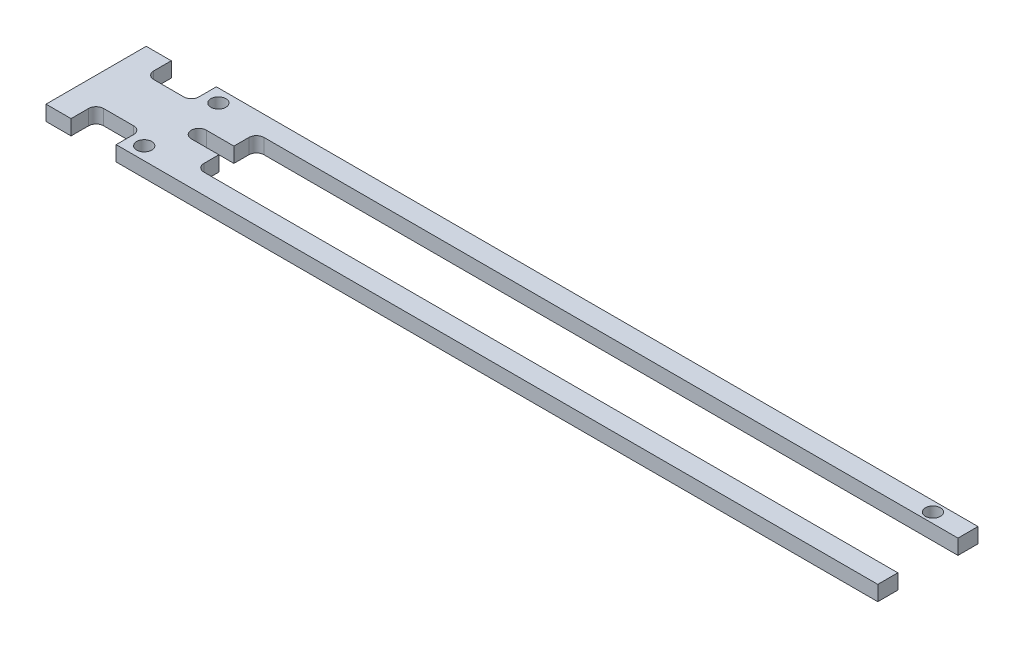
ISO-10303-21;
HEADER;
FILE_DESCRIPTION(('STEP AP214'),'2;1');
FILE_NAME('part.step','',(''),(''),'','','');
FILE_SCHEMA(('AUTOMOTIVE_DESIGN { 1 0 10303 214 1 1 1 1 }'));
ENDSEC;
DATA;
#1=APPLICATION_CONTEXT('core data for automotive mechanical design processes');
#2=APPLICATION_PROTOCOL_DEFINITION('international standard','automotive_design',2000,#1);
#3=PRODUCT_CONTEXT('',#1,'mechanical');
#4=PRODUCT('Part','Part','',(#3));
#5=PRODUCT_RELATED_PRODUCT_CATEGORY('part','',(#4));
#6=PRODUCT_DEFINITION_FORMATION('','',#4);
#7=PRODUCT_DEFINITION_CONTEXT('part definition',#1,'design');
#8=PRODUCT_DEFINITION('design','',#6,#7);
#9=PRODUCT_DEFINITION_SHAPE('','',#8);
#10=(LENGTH_UNIT() NAMED_UNIT(*) SI_UNIT(.MILLI.,.METRE.));
#11=(NAMED_UNIT(*) PLANE_ANGLE_UNIT() SI_UNIT($,.RADIAN.));
#12=(NAMED_UNIT(*) SI_UNIT($,.STERADIAN.) SOLID_ANGLE_UNIT());
#13=UNCERTAINTY_MEASURE_WITH_UNIT(LENGTH_MEASURE(1.E-05),#10,'distance_accuracy_value','');
#14=(GEOMETRIC_REPRESENTATION_CONTEXT(3) GLOBAL_UNCERTAINTY_ASSIGNED_CONTEXT((#13)) GLOBAL_UNIT_ASSIGNED_CONTEXT((#10,
#11,#12)) REPRESENTATION_CONTEXT('',''));
#15=CARTESIAN_POINT('',(0.,0.,0.));
#16=DIRECTION('',(0.,0.,1.));
#17=DIRECTION('',(1.,0.,0.));
#18=AXIS2_PLACEMENT_3D('',#15,#16,#17);
#19=CARTESIAN_POINT('',(-17.2920919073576,1.5,-0.10526315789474));
#20=DIRECTION('',(0.,-1.,0.));
#21=DIRECTION('',(0.,0.,-1.));
#22=AXIS2_PLACEMENT_3D('',#19,#20,#21);
#23=CYLINDRICAL_SURFACE('',#22,0.75);
#24=CARTESIAN_POINT('',(-17.2920919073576,0.,-0.10526315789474));
#25=DIRECTION('',(0.,1.,0.));
#26=DIRECTION('',(0.,0.,1.));
#27=AXIS2_PLACEMENT_3D('',#24,#25,#26);
#28=CIRCLE('',#27,0.75);
#29=CARTESIAN_POINT('',(-17.2920919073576,0.,-0.855263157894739));
#30=VERTEX_POINT('',#29);
#31=CARTESIAN_POINT('',(-17.2920919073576,0.,0.644736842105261));
#32=VERTEX_POINT('',#31);
#33=EDGE_CURVE('E247',#30,#32,#28,.T.);
#34=ORIENTED_EDGE('',*,*,#33,.F.);
#35=DIRECTION('',(0.,-1.,0.));
#36=VECTOR('',#35,1.);
#37=CARTESIAN_POINT('',(-17.2920919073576,1.5,-0.855263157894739));
#38=LINE('',#37,#36);
#39=CARTESIAN_POINT('',(-17.2920919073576,1.5,-0.855263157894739));
#40=VERTEX_POINT('',#39);
#41=EDGE_CURVE('E11',#40,#30,#38,.T.);
#42=ORIENTED_EDGE('',*,*,#41,.F.);
#43=CARTESIAN_POINT('',(-17.2920919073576,1.5,-0.10526315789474));
#44=DIRECTION('',(0.,1.,0.));
#45=DIRECTION('',(0.,0.,1.));
#46=AXIS2_PLACEMENT_3D('',#43,#44,#45);
#47=CIRCLE('',#46,0.75);
#48=CARTESIAN_POINT('',(-17.2920919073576,1.5,0.644736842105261));
#49=VERTEX_POINT('',#48);
#50=EDGE_CURVE('E324',#40,#49,#47,.T.);
#51=ORIENTED_EDGE('',*,*,#50,.T.);
#52=DIRECTION('',(0.,-1.,0.));
#53=VECTOR('',#52,1.);
#54=CARTESIAN_POINT('',(-17.2920919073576,1.5,0.644736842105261));
#55=LINE('',#54,#53);
#56=EDGE_CURVE('E139',#49,#32,#55,.T.);
#57=ORIENTED_EDGE('',*,*,#56,.T.);
#58=EDGE_LOOP('',(#34,#42,#51,#57));
#59=FACE_BOUND('',#58,.T.);
#60=ADVANCED_FACE('F35',(#59),#23,.F.);
#61=CARTESIAN_POINT('',(0.,1.5,-0.855263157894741));
#62=DIRECTION('',(0.,0.,1.));
#63=DIRECTION('',(1.,0.,0.));
#64=AXIS2_PLACEMENT_3D('',#61,#62,#63);
#65=PLANE('',#64);
#66=DIRECTION('',(-1.,0.,0.));
#67=VECTOR('',#66,1.);
#68=CARTESIAN_POINT('',(0.,0.,-0.855263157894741));
#69=LINE('',#68,#67);
#70=CARTESIAN_POINT('',(-14.5420919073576,0.,-0.855263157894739));
#71=VERTEX_POINT('',#70);
#72=EDGE_CURVE('E250',#71,#30,#69,.T.);
#73=ORIENTED_EDGE('',*,*,#72,.F.);
#74=DIRECTION('',(0.,-1.,0.));
#75=VECTOR('',#74,1.);
#76=CARTESIAN_POINT('',(-14.5420919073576,1.5,-0.855263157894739));
#77=LINE('',#76,#75);
#78=CARTESIAN_POINT('',(-14.5420919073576,1.5,-0.855263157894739));
#79=VERTEX_POINT('',#78);
#80=EDGE_CURVE('E43',#79,#71,#77,.T.);
#81=ORIENTED_EDGE('',*,*,#80,.F.);
#82=DIRECTION('',(-1.,0.,0.));
#83=VECTOR('',#82,1.);
#84=CARTESIAN_POINT('',(0.,1.5,-0.855263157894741));
#85=LINE('',#84,#83);
#86=EDGE_CURVE('E395',#79,#40,#85,.T.);
#87=ORIENTED_EDGE('',*,*,#86,.T.);
#88=ORIENTED_EDGE('',*,*,#41,.T.);
#89=EDGE_LOOP('',(#73,#81,#87,#88));
#90=FACE_BOUND('',#89,.T.);
#91=ADVANCED_FACE('F382',(#90),#65,.T.);
#92=CARTESIAN_POINT('',(-14.5420919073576,1.5,0.));
#93=DIRECTION('',(1.,0.,0.));
#94=DIRECTION('',(0.,0.,-1.));
#95=AXIS2_PLACEMENT_3D('',#92,#93,#94);
#96=PLANE('',#95);
#97=DIRECTION('',(0.,0.,1.));
#98=VECTOR('',#97,1.);
#99=CARTESIAN_POINT('',(-14.5420919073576,0.,0.));
#100=LINE('',#99,#98);
#101=CARTESIAN_POINT('',(-14.5420919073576,0.,-2.35526315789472));
#102=VERTEX_POINT('',#101);
#103=EDGE_CURVE('E253',#102,#71,#100,.T.);
#104=ORIENTED_EDGE('',*,*,#103,.F.);
#105=DIRECTION('',(0.,-1.,0.));
#106=VECTOR('',#105,1.);
#107=CARTESIAN_POINT('',(-14.5420919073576,1.5,-2.35526315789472));
#108=LINE('',#107,#106);
#109=CARTESIAN_POINT('',(-14.5420919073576,1.5,-2.35526315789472));
#110=VERTEX_POINT('',#109);
#111=EDGE_CURVE('E371',#110,#102,#108,.T.);
#112=ORIENTED_EDGE('',*,*,#111,.F.);
#113=DIRECTION('',(0.,0.,1.));
#114=VECTOR('',#113,1.);
#115=CARTESIAN_POINT('',(-14.5420919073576,1.5,0.));
#116=LINE('',#115,#114);
#117=EDGE_CURVE('E378',#110,#79,#116,.T.);
#118=ORIENTED_EDGE('',*,*,#117,.T.);
#119=ORIENTED_EDGE('',*,*,#80,.T.);
#120=EDGE_LOOP('',(#104,#112,#118,#119));
#121=FACE_BOUND('',#120,.T.);
#122=ADVANCED_FACE('F376',(#121),#96,.T.);
#123=CARTESIAN_POINT('',(-13.7920919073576,1.5,-2.35526315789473));
#124=DIRECTION('',(0.,-1.,0.));
#125=DIRECTION('',(0.,0.,-1.));
#126=AXIS2_PLACEMENT_3D('',#123,#124,#125);
#127=CYLINDRICAL_SURFACE('',#126,0.75);
#128=CARTESIAN_POINT('',(-13.7920919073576,0.,-2.35526315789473));
#129=DIRECTION('',(0.,1.,0.));
#130=DIRECTION('',(0.,0.,1.));
#131=AXIS2_PLACEMENT_3D('',#128,#129,#130);
#132=CIRCLE('',#131,0.75);
#133=CARTESIAN_POINT('',(-13.7920919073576,0.,-3.10526315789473));
#134=VERTEX_POINT('',#133);
#135=EDGE_CURVE('E256',#134,#102,#132,.T.);
#136=ORIENTED_EDGE('',*,*,#135,.F.);
#137=DIRECTION('',(0.,-1.,0.));
#138=VECTOR('',#137,1.);
#139=CARTESIAN_POINT('',(-13.7920919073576,1.5,-3.10526315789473));
#140=LINE('',#139,#138);
#141=CARTESIAN_POINT('',(-13.7920919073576,1.5,-3.10526315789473));
#142=VERTEX_POINT('',#141);
#143=EDGE_CURVE('E369',#142,#134,#140,.T.);
#144=ORIENTED_EDGE('',*,*,#143,.F.);
#145=CARTESIAN_POINT('',(-13.7920919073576,1.5,-2.35526315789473));
#146=DIRECTION('',(0.,1.,0.));
#147=DIRECTION('',(0.,0.,1.));
#148=AXIS2_PLACEMENT_3D('',#145,#146,#147);
#149=CIRCLE('',#148,0.75);
#150=EDGE_CURVE('E392',#142,#110,#149,.T.);
#151=ORIENTED_EDGE('',*,*,#150,.T.);
#152=ORIENTED_EDGE('',*,*,#111,.T.);
#153=EDGE_LOOP('',(#136,#144,#151,#152));
#154=FACE_BOUND('',#153,.T.);
#155=ADVANCED_FACE('F389',(#154),#127,.F.);
#156=CARTESIAN_POINT('',(0.,1.5,-3.10526315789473));
#157=DIRECTION('',(0.,0.,1.));
#158=DIRECTION('',(1.,0.,0.));
#159=AXIS2_PLACEMENT_3D('',#156,#157,#158);
#160=PLANE('',#159);
#161=DIRECTION('',(-1.,0.,0.));
#162=VECTOR('',#161,1.);
#163=CARTESIAN_POINT('',(0.,0.,-3.10526315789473));
#164=LINE('',#163,#162);
#165=CARTESIAN_POINT('',(55.4579080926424,0.,-3.10526315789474));
#166=VERTEX_POINT('',#165);
#167=EDGE_CURVE('E259',#166,#134,#164,.T.);
#168=ORIENTED_EDGE('',*,*,#167,.F.);
#169=DIRECTION('',(0.,-1.,0.));
#170=VECTOR('',#169,1.);
#171=CARTESIAN_POINT('',(55.4579080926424,1.5,-3.10526315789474));
#172=LINE('',#171,#170);
#173=CARTESIAN_POINT('',(55.4579080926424,1.5,-3.10526315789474));
#174=VERTEX_POINT('',#173);
#175=EDGE_CURVE('E367',#174,#166,#172,.T.);
#176=ORIENTED_EDGE('',*,*,#175,.F.);
#177=DIRECTION('',(-1.,0.,0.));
#178=VECTOR('',#177,1.);
#179=CARTESIAN_POINT('',(0.,1.5,-3.10526315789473));
#180=LINE('',#179,#178);
#181=EDGE_CURVE('E397',#174,#142,#180,.T.);
#182=ORIENTED_EDGE('',*,*,#181,.T.);
#183=ORIENTED_EDGE('',*,*,#143,.T.);
#184=EDGE_LOOP('',(#168,#176,#182,#183));
#185=FACE_BOUND('',#184,.T.);
#186=ADVANCED_FACE('F688',(#185),#160,.T.);
#187=CARTESIAN_POINT('',(55.4579080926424,1.5,0.));
#188=DIRECTION('',(1.,0.,0.));
#189=DIRECTION('',(0.,0.,-1.));
#190=AXIS2_PLACEMENT_3D('',#187,#188,#189);
#191=PLANE('',#190);
#192=DIRECTION('',(0.,0.,1.));
#193=VECTOR('',#192,1.);
#194=CARTESIAN_POINT('',(55.4579080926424,0.,0.));
#195=LINE('',#194,#193);
#196=CARTESIAN_POINT('',(55.4579080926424,0.,-5.10526315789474));
#197=VERTEX_POINT('',#196);
#198=EDGE_CURVE('E262',#197,#166,#195,.T.);
#199=ORIENTED_EDGE('',*,*,#198,.F.);
#200=DIRECTION('',(0.,-1.,0.));
#201=VECTOR('',#200,1.);
#202=CARTESIAN_POINT('',(55.4579080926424,1.5,-5.10526315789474));
#203=LINE('',#202,#201);
#204=CARTESIAN_POINT('',(55.4579080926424,1.5,-5.10526315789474));
#205=VERTEX_POINT('',#204);
#206=EDGE_CURVE('E365',#205,#197,#203,.T.);
#207=ORIENTED_EDGE('',*,*,#206,.F.);
#208=DIRECTION('',(0.,0.,1.));
#209=VECTOR('',#208,1.);
#210=CARTESIAN_POINT('',(55.4579080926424,1.5,0.));
#211=LINE('',#210,#209);
#212=EDGE_CURVE('E403',#205,#174,#211,.T.);
#213=ORIENTED_EDGE('',*,*,#212,.T.);
#214=ORIENTED_EDGE('',*,*,#175,.T.);
#215=EDGE_LOOP('',(#199,#207,#213,#214));
#216=FACE_BOUND('',#215,.T.);
#217=ADVANCED_FACE('F679',(#216),#191,.T.);
#218=CARTESIAN_POINT('',(0.,1.5,-5.10526315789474));
#219=DIRECTION('',(0.,0.,-1.));
#220=DIRECTION('',(-1.,0.,0.));
#221=AXIS2_PLACEMENT_3D('',#218,#219,#220);
#222=PLANE('',#221);
#223=DIRECTION('',(1.,0.,0.));
#224=VECTOR('',#223,1.);
#225=CARTESIAN_POINT('',(0.,0.,-5.10526315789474));
#226=LINE('',#225,#224);
#227=CARTESIAN_POINT('',(-20.5420919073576,0.,-5.10526315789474));
#228=VERTEX_POINT('',#227);
#229=EDGE_CURVE('E265',#228,#197,#226,.T.);
#230=ORIENTED_EDGE('',*,*,#229,.F.);
#231=DIRECTION('',(0.,-1.,0.));
#232=VECTOR('',#231,1.);
#233=CARTESIAN_POINT('',(-20.5420919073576,1.5,-5.10526315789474));
#234=LINE('',#233,#232);
#235=CARTESIAN_POINT('',(-20.5420919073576,1.5,-5.10526315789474));
#236=VERTEX_POINT('',#235);
#237=EDGE_CURVE('E363',#236,#228,#234,.T.);
#238=ORIENTED_EDGE('',*,*,#237,.F.);
#239=DIRECTION('',(1.,0.,0.));
#240=VECTOR('',#239,1.);
#241=CARTESIAN_POINT('',(0.,1.5,-5.10526315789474));
#242=LINE('',#241,#240);
#243=EDGE_CURVE('E406',#236,#205,#242,.T.);
#244=ORIENTED_EDGE('',*,*,#243,.T.);
#245=ORIENTED_EDGE('',*,*,#206,.T.);
#246=EDGE_LOOP('',(#230,#238,#244,#245));
#247=FACE_BOUND('',#246,.T.);
#248=ADVANCED_FACE('F670',(#247),#222,.T.);
#249=CARTESIAN_POINT('',(-20.5420919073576,1.5,0.));
#250=DIRECTION('',(-1.,0.,0.));
#251=DIRECTION('',(0.,0.,1.));
#252=AXIS2_PLACEMENT_3D('',#249,#250,#251);
#253=PLANE('',#252);
#254=DIRECTION('',(0.,0.,-1.));
#255=VECTOR('',#254,1.);
#256=CARTESIAN_POINT('',(-20.5420919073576,0.,0.));
#257=LINE('',#256,#255);
#258=CARTESIAN_POINT('',(-20.5420919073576,0.,-3.35526315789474));
#259=VERTEX_POINT('',#258);
#260=EDGE_CURVE('E268',#259,#228,#257,.T.);
#261=ORIENTED_EDGE('',*,*,#260,.F.);
#262=DIRECTION('',(0.,-1.,0.));
#263=VECTOR('',#262,1.);
#264=CARTESIAN_POINT('',(-20.5420919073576,1.5,-3.35526315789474));
#265=LINE('',#264,#263);
#266=CARTESIAN_POINT('',(-20.5420919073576,1.5,-3.35526315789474));
#267=VERTEX_POINT('',#266);
#268=EDGE_CURVE('E361',#267,#259,#265,.T.);
#269=ORIENTED_EDGE('',*,*,#268,.F.);
#270=DIRECTION('',(0.,0.,-1.));
#271=VECTOR('',#270,1.);
#272=CARTESIAN_POINT('',(-20.5420919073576,1.5,0.));
#273=LINE('',#272,#271);
#274=EDGE_CURVE('E409',#267,#236,#273,.T.);
#275=ORIENTED_EDGE('',*,*,#274,.T.);
#276=ORIENTED_EDGE('',*,*,#237,.T.);
#277=EDGE_LOOP('',(#261,#269,#275,#276));
#278=FACE_BOUND('',#277,.T.);
#279=ADVANCED_FACE('F661',(#278),#253,.T.);
#280=CARTESIAN_POINT('',(-21.2920919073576,1.5,-3.35526315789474));
#281=DIRECTION('',(0.,-1.,0.));
#282=DIRECTION('',(0.,0.,-1.));
#283=AXIS2_PLACEMENT_3D('',#280,#281,#282);
#284=CYLINDRICAL_SURFACE('',#283,0.75);
#285=CARTESIAN_POINT('',(-21.2920919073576,0.,-3.35526315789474));
#286=DIRECTION('',(0.,1.,0.));
#287=DIRECTION('',(0.,0.,1.));
#288=AXIS2_PLACEMENT_3D('',#285,#286,#287);
#289=CIRCLE('',#288,0.75);
#290=CARTESIAN_POINT('',(-21.2920919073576,0.,-2.60526315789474));
#291=VERTEX_POINT('',#290);
#292=EDGE_CURVE('E271',#291,#259,#289,.T.);
#293=ORIENTED_EDGE('',*,*,#292,.F.);
#294=DIRECTION('',(0.,-1.,0.));
#295=VECTOR('',#294,1.);
#296=CARTESIAN_POINT('',(-21.2920919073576,1.5,-2.60526315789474));
#297=LINE('',#296,#295);
#298=CARTESIAN_POINT('',(-21.2920919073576,1.5,-2.60526315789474));
#299=VERTEX_POINT('',#298);
#300=EDGE_CURVE('E359',#299,#291,#297,.T.);
#301=ORIENTED_EDGE('',*,*,#300,.F.);
#302=CARTESIAN_POINT('',(-21.2920919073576,1.5,-3.35526315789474));
#303=DIRECTION('',(0.,1.,0.));
#304=DIRECTION('',(0.,0.,1.));
#305=AXIS2_PLACEMENT_3D('',#302,#303,#304);
#306=CIRCLE('',#305,0.75);
#307=EDGE_CURVE('E412',#299,#267,#306,.T.);
#308=ORIENTED_EDGE('',*,*,#307,.T.);
#309=ORIENTED_EDGE('',*,*,#268,.T.);
#310=EDGE_LOOP('',(#293,#301,#308,#309));
#311=FACE_BOUND('',#310,.T.);
#312=ADVANCED_FACE('F652',(#311),#284,.F.);
#313=CARTESIAN_POINT('',(0.,1.5,-2.60526315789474));
#314=DIRECTION('',(0.,0.,-1.));
#315=DIRECTION('',(-1.,0.,0.));
#316=AXIS2_PLACEMENT_3D('',#313,#314,#315);
#317=PLANE('',#316);
#318=DIRECTION('',(1.,0.,0.));
#319=VECTOR('',#318,1.);
#320=CARTESIAN_POINT('',(0.,0.,-2.60526315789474));
#321=LINE('',#320,#319);
#322=CARTESIAN_POINT('',(-24.2920919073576,0.,-2.60526315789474));
#323=VERTEX_POINT('',#322);
#324=EDGE_CURVE('E274',#323,#291,#321,.T.);
#325=ORIENTED_EDGE('',*,*,#324,.F.);
#326=DIRECTION('',(0.,-1.,0.));
#327=VECTOR('',#326,1.);
#328=CARTESIAN_POINT('',(-24.2920919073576,1.5,-2.60526315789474));
#329=LINE('',#328,#327);
#330=CARTESIAN_POINT('',(-24.2920919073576,1.5,-2.60526315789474));
#331=VERTEX_POINT('',#330);
#332=EDGE_CURVE('E357',#331,#323,#329,.T.);
#333=ORIENTED_EDGE('',*,*,#332,.F.);
#334=DIRECTION('',(1.,0.,0.));
#335=VECTOR('',#334,1.);
#336=CARTESIAN_POINT('',(0.,1.5,-2.60526315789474));
#337=LINE('',#336,#335);
#338=EDGE_CURVE('E415',#331,#299,#337,.T.);
#339=ORIENTED_EDGE('',*,*,#338,.T.);
#340=ORIENTED_EDGE('',*,*,#300,.T.);
#341=EDGE_LOOP('',(#325,#333,#339,#340));
#342=FACE_BOUND('',#341,.T.);
#343=ADVANCED_FACE('F643',(#342),#317,.T.);
#344=CARTESIAN_POINT('',(-24.2920919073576,1.5,-3.35526315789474));
#345=DIRECTION('',(0.,-1.,0.));
#346=DIRECTION('',(0.,0.,-1.));
#347=AXIS2_PLACEMENT_3D('',#344,#345,#346);
#348=CYLINDRICAL_SURFACE('',#347,0.749999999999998);
#349=CARTESIAN_POINT('',(-24.2920919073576,0.,-3.35526315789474));
#350=DIRECTION('',(0.,1.,0.));
#351=DIRECTION('',(0.,0.,1.));
#352=AXIS2_PLACEMENT_3D('',#349,#350,#351);
#353=CIRCLE('',#352,0.749999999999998);
#354=CARTESIAN_POINT('',(-25.0420919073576,0.,-3.35526315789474));
#355=VERTEX_POINT('',#354);
#356=EDGE_CURVE('E277',#323,#355,#353,.F.);
#357=ORIENTED_EDGE('',*,*,#356,.T.);
#358=DIRECTION('',(0.,-1.,0.));
#359=VECTOR('',#358,1.);
#360=CARTESIAN_POINT('',(-25.0420919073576,1.5,-3.35526315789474));
#361=LINE('',#360,#359);
#362=CARTESIAN_POINT('',(-25.0420919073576,1.5,-3.35526315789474));
#363=VERTEX_POINT('',#362);
#364=EDGE_CURVE('E355',#363,#355,#361,.T.);
#365=ORIENTED_EDGE('',*,*,#364,.F.);
#366=CARTESIAN_POINT('',(-24.2920919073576,1.5,-3.35526315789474));
#367=DIRECTION('',(0.,1.,0.));
#368=DIRECTION('',(0.,0.,1.));
#369=AXIS2_PLACEMENT_3D('',#366,#367,#368);
#370=CIRCLE('',#369,0.749999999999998);
#371=EDGE_CURVE('E418',#331,#363,#370,.F.);
#372=ORIENTED_EDGE('',*,*,#371,.F.);
#373=ORIENTED_EDGE('',*,*,#332,.T.);
#374=EDGE_LOOP('',(#357,#365,#372,#373));
#375=FACE_BOUND('',#374,.T.);
#376=ADVANCED_FACE('F634',(#375),#348,.F.);
#377=CARTESIAN_POINT('',(-25.0420919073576,1.5,0.));
#378=DIRECTION('',(1.,0.,0.));
#379=DIRECTION('',(0.,0.,-1.));
#380=AXIS2_PLACEMENT_3D('',#377,#378,#379);
#381=PLANE('',#380);
#382=DIRECTION('',(0.,0.,1.));
#383=VECTOR('',#382,1.);
#384=CARTESIAN_POINT('',(-25.0420919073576,0.,0.));
#385=LINE('',#384,#383);
#386=CARTESIAN_POINT('',(-25.0420919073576,0.,-5.10526315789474));
#387=VERTEX_POINT('',#386);
#388=EDGE_CURVE('E280',#387,#355,#385,.T.);
#389=ORIENTED_EDGE('',*,*,#388,.F.);
#390=DIRECTION('',(0.,-1.,0.));
#391=VECTOR('',#390,1.);
#392=CARTESIAN_POINT('',(-25.0420919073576,1.5,-5.10526315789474));
#393=LINE('',#392,#391);
#394=CARTESIAN_POINT('',(-25.0420919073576,1.5,-5.10526315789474));
#395=VERTEX_POINT('',#394);
#396=EDGE_CURVE('E353',#395,#387,#393,.T.);
#397=ORIENTED_EDGE('',*,*,#396,.F.);
#398=DIRECTION('',(0.,0.,1.));
#399=VECTOR('',#398,1.);
#400=CARTESIAN_POINT('',(-25.0420919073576,1.5,0.));
#401=LINE('',#400,#399);
#402=EDGE_CURVE('E420',#395,#363,#401,.T.);
#403=ORIENTED_EDGE('',*,*,#402,.T.);
#404=ORIENTED_EDGE('',*,*,#364,.T.);
#405=EDGE_LOOP('',(#389,#397,#403,#404));
#406=FACE_BOUND('',#405,.T.);
#407=ADVANCED_FACE('F625',(#406),#381,.T.);
#408=CARTESIAN_POINT('',(0.,1.5,-5.10526315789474));
#409=DIRECTION('',(0.,0.,-1.));
#410=DIRECTION('',(-1.,0.,0.));
#411=AXIS2_PLACEMENT_3D('',#408,#409,#410);
#412=PLANE('',#411);
#413=DIRECTION('',(1.,0.,0.));
#414=VECTOR('',#413,1.);
#415=CARTESIAN_POINT('',(0.,0.,-5.10526315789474));
#416=LINE('',#415,#414);
#417=CARTESIAN_POINT('',(-27.5420919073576,0.,-5.10526315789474));
#418=VERTEX_POINT('',#417);
#419=EDGE_CURVE('E283',#418,#387,#416,.T.);
#420=ORIENTED_EDGE('',*,*,#419,.F.);
#421=DIRECTION('',(0.,-1.,0.));
#422=VECTOR('',#421,1.);
#423=CARTESIAN_POINT('',(-27.5420919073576,1.5,-5.10526315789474));
#424=LINE('',#423,#422);
#425=CARTESIAN_POINT('',(-27.5420919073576,1.5,-5.10526315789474));
#426=VERTEX_POINT('',#425);
#427=EDGE_CURVE('E351',#426,#418,#424,.T.);
#428=ORIENTED_EDGE('',*,*,#427,.F.);
#429=DIRECTION('',(1.,0.,0.));
#430=VECTOR('',#429,1.);
#431=CARTESIAN_POINT('',(0.,1.5,-5.10526315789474));
#432=LINE('',#431,#430);
#433=EDGE_CURVE('E423',#426,#395,#432,.T.);
#434=ORIENTED_EDGE('',*,*,#433,.T.);
#435=ORIENTED_EDGE('',*,*,#396,.T.);
#436=EDGE_LOOP('',(#420,#428,#434,#435));
#437=FACE_BOUND('',#436,.T.);
#438=ADVANCED_FACE('F616',(#437),#412,.T.);
#439=CARTESIAN_POINT('',(-27.5420919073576,1.5,0.));
#440=DIRECTION('',(1.,0.,0.));
#441=DIRECTION('',(0.,0.,-1.));
#442=AXIS2_PLACEMENT_3D('',#439,#440,#441);
#443=PLANE('',#442);
#444=DIRECTION('',(0.,0.,1.));
#445=VECTOR('',#444,1.);
#446=CARTESIAN_POINT('',(-27.5420919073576,0.,0.));
#447=LINE('',#446,#445);
#448=CARTESIAN_POINT('',(-27.5420919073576,0.,4.89473684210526));
#449=VERTEX_POINT('',#448);
#450=EDGE_CURVE('E286',#418,#449,#447,.T.);
#451=ORIENTED_EDGE('',*,*,#450,.T.);
#452=DIRECTION('',(0.,-1.,0.));
#453=VECTOR('',#452,1.);
#454=CARTESIAN_POINT('',(-27.5420919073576,1.5,4.89473684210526));
#455=LINE('',#454,#453);
#456=CARTESIAN_POINT('',(-27.5420919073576,1.5,4.89473684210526));
#457=VERTEX_POINT('',#456);
#458=EDGE_CURVE('E348',#457,#449,#455,.T.);
#459=ORIENTED_EDGE('',*,*,#458,.F.);
#460=DIRECTION('',(0.,0.,1.));
#461=VECTOR('',#460,1.);
#462=CARTESIAN_POINT('',(-27.5420919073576,1.5,0.));
#463=LINE('',#462,#461);
#464=EDGE_CURVE('E426',#426,#457,#463,.T.);
#465=ORIENTED_EDGE('',*,*,#464,.F.);
#466=ORIENTED_EDGE('',*,*,#427,.T.);
#467=EDGE_LOOP('',(#451,#459,#465,#466));
#468=FACE_BOUND('',#467,.T.);
#469=ADVANCED_FACE('F607',(#468),#443,.F.);
#470=CARTESIAN_POINT('',(0.,1.5,4.89473684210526));
#471=DIRECTION('',(0.,0.,-1.));
#472=DIRECTION('',(-1.,0.,0.));
#473=AXIS2_PLACEMENT_3D('',#470,#471,#472);
#474=PLANE('',#473);
#475=DIRECTION('',(1.,0.,0.));
#476=VECTOR('',#475,1.);
#477=CARTESIAN_POINT('',(0.,0.,4.89473684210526));
#478=LINE('',#477,#476);
#479=CARTESIAN_POINT('',(-25.0420919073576,0.,4.89473684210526));
#480=VERTEX_POINT('',#479);
#481=EDGE_CURVE('E288',#449,#480,#478,.T.);
#482=ORIENTED_EDGE('',*,*,#481,.T.);
#483=DIRECTION('',(0.,-1.,0.));
#484=VECTOR('',#483,1.);
#485=CARTESIAN_POINT('',(-25.0420919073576,1.5,4.89473684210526));
#486=LINE('',#485,#484);
#487=CARTESIAN_POINT('',(-25.0420919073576,1.5,4.89473684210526));
#488=VERTEX_POINT('',#487);
#489=EDGE_CURVE('E346',#488,#480,#486,.T.);
#490=ORIENTED_EDGE('',*,*,#489,.F.);
#491=DIRECTION('',(1.,0.,0.));
#492=VECTOR('',#491,1.);
#493=CARTESIAN_POINT('',(0.,1.5,4.89473684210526));
#494=LINE('',#493,#492);
#495=EDGE_CURVE('E428',#457,#488,#494,.T.);
#496=ORIENTED_EDGE('',*,*,#495,.F.);
#497=ORIENTED_EDGE('',*,*,#458,.T.);
#498=EDGE_LOOP('',(#482,#490,#496,#497));
#499=FACE_BOUND('',#498,.T.);
#500=ADVANCED_FACE('F598',(#499),#474,.F.);
#501=CARTESIAN_POINT('',(-25.0420919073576,1.5,0.));
#502=DIRECTION('',(1.,0.,0.));
#503=DIRECTION('',(0.,0.,-1.));
#504=AXIS2_PLACEMENT_3D('',#501,#502,#503);
#505=PLANE('',#504);
#506=DIRECTION('',(0.,0.,1.));
#507=VECTOR('',#506,1.);
#508=CARTESIAN_POINT('',(-25.0420919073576,0.,0.));
#509=LINE('',#508,#507);
#510=CARTESIAN_POINT('',(-25.0420919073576,0.,3.14473684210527));
#511=VERTEX_POINT('',#510);
#512=EDGE_CURVE('E291',#511,#480,#509,.T.);
#513=ORIENTED_EDGE('',*,*,#512,.F.);
#514=DIRECTION('',(0.,-1.,0.));
#515=VECTOR('',#514,1.);
#516=CARTESIAN_POINT('',(-25.0420919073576,1.5,3.14473684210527));
#517=LINE('',#516,#515);
#518=CARTESIAN_POINT('',(-25.0420919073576,1.5,3.14473684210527));
#519=VERTEX_POINT('',#518);
#520=EDGE_CURVE('E344',#519,#511,#517,.T.);
#521=ORIENTED_EDGE('',*,*,#520,.F.);
#522=DIRECTION('',(0.,0.,1.));
#523=VECTOR('',#522,1.);
#524=CARTESIAN_POINT('',(-25.0420919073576,1.5,0.));
#525=LINE('',#524,#523);
#526=EDGE_CURVE('E430',#519,#488,#525,.T.);
#527=ORIENTED_EDGE('',*,*,#526,.T.);
#528=ORIENTED_EDGE('',*,*,#489,.T.);
#529=EDGE_LOOP('',(#513,#521,#527,#528));
#530=FACE_BOUND('',#529,.T.);
#531=ADVANCED_FACE('F589',(#530),#505,.T.);
#532=CARTESIAN_POINT('',(-24.2920919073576,1.5,3.14473684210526));
#533=DIRECTION('',(0.,-1.,0.));
#534=DIRECTION('',(0.,0.,-1.));
#535=AXIS2_PLACEMENT_3D('',#532,#533,#534);
#536=CYLINDRICAL_SURFACE('',#535,0.749999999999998);
#537=CARTESIAN_POINT('',(-24.2920919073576,0.,3.14473684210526));
#538=DIRECTION('',(0.,1.,0.));
#539=DIRECTION('',(0.,0.,1.));
#540=AXIS2_PLACEMENT_3D('',#537,#538,#539);
#541=CIRCLE('',#540,0.749999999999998);
#542=CARTESIAN_POINT('',(-24.2920919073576,0.,2.39473684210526));
#543=VERTEX_POINT('',#542);
#544=EDGE_CURVE('E294',#511,#543,#541,.F.);
#545=ORIENTED_EDGE('',*,*,#544,.T.);
#546=DIRECTION('',(0.,-1.,0.));
#547=VECTOR('',#546,1.);
#548=CARTESIAN_POINT('',(-24.2920919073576,1.5,2.39473684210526));
#549=LINE('',#548,#547);
#550=CARTESIAN_POINT('',(-24.2920919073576,1.5,2.39473684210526));
#551=VERTEX_POINT('',#550);
#552=EDGE_CURVE('E341',#551,#543,#549,.T.);
#553=ORIENTED_EDGE('',*,*,#552,.F.);
#554=CARTESIAN_POINT('',(-24.2920919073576,1.5,3.14473684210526));
#555=DIRECTION('',(0.,1.,0.));
#556=DIRECTION('',(0.,0.,1.));
#557=AXIS2_PLACEMENT_3D('',#554,#555,#556);
#558=CIRCLE('',#557,0.749999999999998);
#559=EDGE_CURVE('E433',#519,#551,#558,.F.);
#560=ORIENTED_EDGE('',*,*,#559,.F.);
#561=ORIENTED_EDGE('',*,*,#520,.T.);
#562=EDGE_LOOP('',(#545,#553,#560,#561));
#563=FACE_BOUND('',#562,.T.);
#564=ADVANCED_FACE('F580',(#563),#536,.F.);
#565=CARTESIAN_POINT('',(0.,1.5,2.39473684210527));
#566=DIRECTION('',(0.,0.,-1.));
#567=DIRECTION('',(-1.,0.,0.));
#568=AXIS2_PLACEMENT_3D('',#565,#566,#567);
#569=PLANE('',#568);
#570=DIRECTION('',(1.,0.,0.));
#571=VECTOR('',#570,1.);
#572=CARTESIAN_POINT('',(0.,0.,2.39473684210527));
#573=LINE('',#572,#571);
#574=CARTESIAN_POINT('',(-21.2920919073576,0.,2.39473684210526));
#575=VERTEX_POINT('',#574);
#576=EDGE_CURVE('E296',#543,#575,#573,.T.);
#577=ORIENTED_EDGE('',*,*,#576,.T.);
#578=DIRECTION('',(0.,-1.,0.));
#579=VECTOR('',#578,1.);
#580=CARTESIAN_POINT('',(-21.2920919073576,1.5,2.39473684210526));
#581=LINE('',#580,#579);
#582=CARTESIAN_POINT('',(-21.2920919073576,1.5,2.39473684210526));
#583=VERTEX_POINT('',#582);
#584=EDGE_CURVE('E338',#583,#575,#581,.T.);
#585=ORIENTED_EDGE('',*,*,#584,.F.);
#586=DIRECTION('',(1.,0.,0.));
#587=VECTOR('',#586,1.);
#588=CARTESIAN_POINT('',(0.,1.5,2.39473684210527));
#589=LINE('',#588,#587);
#590=EDGE_CURVE('E435',#551,#583,#589,.T.);
#591=ORIENTED_EDGE('',*,*,#590,.F.);
#592=ORIENTED_EDGE('',*,*,#552,.T.);
#593=EDGE_LOOP('',(#577,#585,#591,#592));
#594=FACE_BOUND('',#593,.T.);
#595=ADVANCED_FACE('F571',(#594),#569,.F.);
#596=CARTESIAN_POINT('',(-21.2920919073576,1.5,3.14473684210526));
#597=DIRECTION('',(0.,-1.,0.));
#598=DIRECTION('',(0.,0.,-1.));
#599=AXIS2_PLACEMENT_3D('',#596,#597,#598);
#600=CYLINDRICAL_SURFACE('',#599,0.75);
#601=CARTESIAN_POINT('',(-21.2920919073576,0.,3.14473684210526));
#602=DIRECTION('',(0.,1.,0.));
#603=DIRECTION('',(0.,0.,1.));
#604=AXIS2_PLACEMENT_3D('',#601,#602,#603);
#605=CIRCLE('',#604,0.75);
#606=CARTESIAN_POINT('',(-20.5420919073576,0.,3.14473684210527));
#607=VERTEX_POINT('',#606);
#608=EDGE_CURVE('E298',#575,#607,#605,.F.);
#609=ORIENTED_EDGE('',*,*,#608,.T.);
#610=DIRECTION('',(0.,-1.,0.));
#611=VECTOR('',#610,1.);
#612=CARTESIAN_POINT('',(-20.5420919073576,1.5,3.14473684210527));
#613=LINE('',#612,#611);
#614=CARTESIAN_POINT('',(-20.5420919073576,1.5,3.14473684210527));
#615=VERTEX_POINT('',#614);
#616=EDGE_CURVE('E335',#615,#607,#613,.T.);
#617=ORIENTED_EDGE('',*,*,#616,.F.);
#618=CARTESIAN_POINT('',(-21.2920919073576,1.5,3.14473684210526));
#619=DIRECTION('',(0.,1.,0.));
#620=DIRECTION('',(0.,0.,1.));
#621=AXIS2_PLACEMENT_3D('',#618,#619,#620);
#622=CIRCLE('',#621,0.75);
#623=EDGE_CURVE('E437',#583,#615,#622,.F.);
#624=ORIENTED_EDGE('',*,*,#623,.F.);
#625=ORIENTED_EDGE('',*,*,#584,.T.);
#626=EDGE_LOOP('',(#609,#617,#624,#625));
#627=FACE_BOUND('',#626,.T.);
#628=ADVANCED_FACE('F562',(#627),#600,.F.);
#629=CARTESIAN_POINT('',(-20.5420919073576,1.5,0.));
#630=DIRECTION('',(1.,0.,0.));
#631=DIRECTION('',(0.,0.,-1.));
#632=AXIS2_PLACEMENT_3D('',#629,#630,#631);
#633=PLANE('',#632);
#634=DIRECTION('',(0.,0.,1.));
#635=VECTOR('',#634,1.);
#636=CARTESIAN_POINT('',(-20.5420919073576,0.,0.));
#637=LINE('',#636,#635);
#638=CARTESIAN_POINT('',(-20.5420919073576,0.,4.89473684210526));
#639=VERTEX_POINT('',#638);
#640=EDGE_CURVE('E300',#607,#639,#637,.T.);
#641=ORIENTED_EDGE('',*,*,#640,.T.);
#642=DIRECTION('',(0.,-1.,0.));
#643=VECTOR('',#642,1.);
#644=CARTESIAN_POINT('',(-20.5420919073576,1.5,4.89473684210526));
#645=LINE('',#644,#643);
#646=CARTESIAN_POINT('',(-20.5420919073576,1.5,4.89473684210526));
#647=VERTEX_POINT('',#646);
#648=EDGE_CURVE('E332',#647,#639,#645,.T.);
#649=ORIENTED_EDGE('',*,*,#648,.F.);
#650=DIRECTION('',(0.,0.,1.));
#651=VECTOR('',#650,1.);
#652=CARTESIAN_POINT('',(-20.5420919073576,1.5,0.));
#653=LINE('',#652,#651);
#654=EDGE_CURVE('E439',#615,#647,#653,.T.);
#655=ORIENTED_EDGE('',*,*,#654,.F.);
#656=ORIENTED_EDGE('',*,*,#616,.T.);
#657=EDGE_LOOP('',(#641,#649,#655,#656));
#658=FACE_BOUND('',#657,.T.);
#659=ADVANCED_FACE('F554',(#658),#633,.F.);
#660=CARTESIAN_POINT('',(0.,1.5,4.89473684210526));
#661=DIRECTION('',(0.,0.,-1.));
#662=DIRECTION('',(-1.,0.,0.));
#663=AXIS2_PLACEMENT_3D('',#660,#661,#662);
#664=PLANE('',#663);
#665=DIRECTION('',(1.,0.,0.));
#666=VECTOR('',#665,1.);
#667=CARTESIAN_POINT('',(0.,0.,4.89473684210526));
#668=LINE('',#667,#666);
#669=CARTESIAN_POINT('',(55.4579080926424,0.,4.89473684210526));
#670=VERTEX_POINT('',#669);
#671=EDGE_CURVE('E302',#639,#670,#668,.T.);
#672=ORIENTED_EDGE('',*,*,#671,.T.);
#673=DIRECTION('',(0.,-1.,0.));
#674=VECTOR('',#673,1.);
#675=CARTESIAN_POINT('',(55.4579080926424,1.5,4.89473684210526));
#676=LINE('',#675,#674);
#677=CARTESIAN_POINT('',(55.4579080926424,1.5,4.89473684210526));
#678=VERTEX_POINT('',#677);
#679=EDGE_CURVE('E330',#678,#670,#676,.T.);
#680=ORIENTED_EDGE('',*,*,#679,.F.);
#681=DIRECTION('',(1.,0.,0.));
#682=VECTOR('',#681,1.);
#683=CARTESIAN_POINT('',(0.,1.5,4.89473684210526));
#684=LINE('',#683,#682);
#685=EDGE_CURVE('E441',#647,#678,#684,.T.);
#686=ORIENTED_EDGE('',*,*,#685,.F.);
#687=ORIENTED_EDGE('',*,*,#648,.T.);
#688=EDGE_LOOP('',(#672,#680,#686,#687));
#689=FACE_BOUND('',#688,.T.);
#690=ADVANCED_FACE('F453',(#689),#664,.F.);
#691=CARTESIAN_POINT('',(55.4579080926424,1.5,0.));
#692=DIRECTION('',(1.,0.,0.));
#693=DIRECTION('',(0.,0.,-1.));
#694=AXIS2_PLACEMENT_3D('',#691,#692,#693);
#695=PLANE('',#694);
#696=DIRECTION('',(0.,0.,1.));
#697=VECTOR('',#696,1.);
#698=CARTESIAN_POINT('',(55.4579080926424,0.,0.));
#699=LINE('',#698,#697);
#700=CARTESIAN_POINT('',(55.4579080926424,0.,2.89473684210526));
#701=VERTEX_POINT('',#700);
#702=EDGE_CURVE('E305',#701,#670,#699,.T.);
#703=ORIENTED_EDGE('',*,*,#702,.F.);
#704=DIRECTION('',(0.,-1.,0.));
#705=VECTOR('',#704,1.);
#706=CARTESIAN_POINT('',(55.4579080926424,1.5,2.89473684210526));
#707=LINE('',#706,#705);
#708=CARTESIAN_POINT('',(55.4579080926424,1.5,2.89473684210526));
#709=VERTEX_POINT('',#708);
#710=EDGE_CURVE('E328',#709,#701,#707,.T.);
#711=ORIENTED_EDGE('',*,*,#710,.F.);
#712=DIRECTION('',(0.,0.,1.));
#713=VECTOR('',#712,1.);
#714=CARTESIAN_POINT('',(55.4579080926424,1.5,0.));
#715=LINE('',#714,#713);
#716=EDGE_CURVE('E443',#709,#678,#715,.T.);
#717=ORIENTED_EDGE('',*,*,#716,.T.);
#718=ORIENTED_EDGE('',*,*,#679,.T.);
#719=EDGE_LOOP('',(#703,#711,#717,#718));
#720=FACE_BOUND('',#719,.T.);
#721=ADVANCED_FACE('F447',(#720),#695,.T.);
#722=CARTESIAN_POINT('',(0.,1.5,2.89473684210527));
#723=DIRECTION('',(0.,0.,1.));
#724=DIRECTION('',(1.,0.,0.));
#725=AXIS2_PLACEMENT_3D('',#722,#723,#724);
#726=PLANE('',#725);
#727=DIRECTION('',(-1.,0.,0.));
#728=VECTOR('',#727,1.);
#729=CARTESIAN_POINT('',(0.,0.,2.89473684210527));
#730=LINE('',#729,#728);
#731=CARTESIAN_POINT('',(-13.7920919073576,0.,2.89473684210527));
#732=VERTEX_POINT('',#731);
#733=EDGE_CURVE('E308',#701,#732,#730,.T.);
#734=ORIENTED_EDGE('',*,*,#733,.T.);
#735=DIRECTION('',(0.,-1.,0.));
#736=VECTOR('',#735,1.);
#737=CARTESIAN_POINT('',(-13.7920919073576,1.5,2.89473684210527));
#738=LINE('',#737,#736);
#739=CARTESIAN_POINT('',(-13.7920919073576,1.5,2.89473684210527));
#740=VERTEX_POINT('',#739);
#741=EDGE_CURVE('E231',#740,#732,#738,.T.);
#742=ORIENTED_EDGE('',*,*,#741,.F.);
#743=DIRECTION('',(-1.,0.,0.));
#744=VECTOR('',#743,1.);
#745=CARTESIAN_POINT('',(0.,1.5,2.89473684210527));
#746=LINE('',#745,#744);
#747=EDGE_CURVE('E218',#709,#740,#746,.T.);
#748=ORIENTED_EDGE('',*,*,#747,.F.);
#749=ORIENTED_EDGE('',*,*,#710,.T.);
#750=EDGE_LOOP('',(#734,#742,#748,#749));
#751=FACE_BOUND('',#750,.T.);
#752=ADVANCED_FACE('F458',(#751),#726,.F.);
#753=CARTESIAN_POINT('',(-13.7920919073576,1.5,2.14473684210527));
#754=DIRECTION('',(0.,-1.,0.));
#755=DIRECTION('',(0.,0.,-1.));
#756=AXIS2_PLACEMENT_3D('',#753,#754,#755);
#757=CYLINDRICAL_SURFACE('',#756,0.75);
#758=CARTESIAN_POINT('',(-13.7920919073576,0.,2.14473684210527));
#759=DIRECTION('',(0.,1.,0.));
#760=DIRECTION('',(0.,0.,1.));
#761=AXIS2_PLACEMENT_3D('',#758,#759,#760);
#762=CIRCLE('',#761,0.75);
#763=CARTESIAN_POINT('',(-14.5420919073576,0.,2.14473684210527));
#764=VERTEX_POINT('',#763);
#765=EDGE_CURVE('E227',#732,#764,#762,.F.);
#766=ORIENTED_EDGE('',*,*,#765,.T.);
#767=DIRECTION('',(0.,-1.,0.));
#768=VECTOR('',#767,1.);
#769=CARTESIAN_POINT('',(-14.5420919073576,1.5,2.14473684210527));
#770=LINE('',#769,#768);
#771=CARTESIAN_POINT('',(-14.5420919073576,1.5,2.14473684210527));
#772=VERTEX_POINT('',#771);
#773=EDGE_CURVE('E224',#772,#764,#770,.T.);
#774=ORIENTED_EDGE('',*,*,#773,.F.);
#775=CARTESIAN_POINT('',(-13.7920919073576,1.5,2.14473684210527));
#776=DIRECTION('',(0.,1.,0.));
#777=DIRECTION('',(0.,0.,1.));
#778=AXIS2_PLACEMENT_3D('',#775,#776,#777);
#779=CIRCLE('',#778,0.75);
#780=EDGE_CURVE('E210',#740,#772,#779,.F.);
#781=ORIENTED_EDGE('',*,*,#780,.F.);
#782=ORIENTED_EDGE('',*,*,#741,.T.);
#783=EDGE_LOOP('',(#766,#774,#781,#782));
#784=FACE_BOUND('',#783,.T.);
#785=ADVANCED_FACE('F225',(#784),#757,.F.);
#786=CARTESIAN_POINT('',(-14.5420919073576,1.5,0.));
#787=DIRECTION('',(1.,0.,0.));
#788=DIRECTION('',(0.,0.,-1.));
#789=AXIS2_PLACEMENT_3D('',#786,#787,#788);
#790=PLANE('',#789);
#791=DIRECTION('',(0.,0.,1.));
#792=VECTOR('',#791,1.);
#793=CARTESIAN_POINT('',(-14.5420919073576,0.,0.));
#794=LINE('',#793,#792);
#795=CARTESIAN_POINT('',(-14.5420919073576,0.,0.644736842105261));
#796=VERTEX_POINT('',#795);
#797=EDGE_CURVE('E311',#796,#764,#794,.T.);
#798=ORIENTED_EDGE('',*,*,#797,.F.);
#799=DIRECTION('',(0.,-1.,0.));
#800=VECTOR('',#799,1.);
#801=CARTESIAN_POINT('',(-14.5420919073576,1.5,0.644736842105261));
#802=LINE('',#801,#800);
#803=CARTESIAN_POINT('',(-14.5420919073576,1.5,0.644736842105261));
#804=VERTEX_POINT('',#803);
#805=EDGE_CURVE('E132',#804,#796,#802,.T.);
#806=ORIENTED_EDGE('',*,*,#805,.F.);
#807=DIRECTION('',(0.,0.,1.));
#808=VECTOR('',#807,1.);
#809=CARTESIAN_POINT('',(-14.5420919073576,1.5,0.));
#810=LINE('',#809,#808);
#811=EDGE_CURVE('E215',#804,#772,#810,.T.);
#812=ORIENTED_EDGE('',*,*,#811,.T.);
#813=ORIENTED_EDGE('',*,*,#773,.T.);
#814=EDGE_LOOP('',(#798,#806,#812,#813));
#815=FACE_BOUND('',#814,.T.);
#816=ADVANCED_FACE('F233',(#815),#790,.T.);
#817=CARTESIAN_POINT('',(-19.0420919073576,1.5,3.59473684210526));
#818=DIRECTION('',(0.,-1.,0.));
#819=DIRECTION('',(0.,0.,-1.));
#820=AXIS2_PLACEMENT_3D('',#817,#818,#819);
#821=CYLINDRICAL_SURFACE('',#820,0.750000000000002);
#822=CARTESIAN_POINT('',(-19.0420919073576,1.5,3.59473684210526));
#823=DIRECTION('',(0.,1.,0.));
#824=DIRECTION('',(0.,0.,1.));
#825=AXIS2_PLACEMENT_3D('',#822,#823,#824);
#826=CIRCLE('',#825,0.750000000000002);
#827=CARTESIAN_POINT('',(-19.0420919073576,1.5,4.34473684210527));
#828=VERTEX_POINT('',#827);
#829=EDGE_CURVE('E241',#828,#828,#826,.T.);
#830=ORIENTED_EDGE('',*,*,#829,.T.);
#831=EDGE_LOOP('',(#830));
#832=FACE_BOUND('',#831,.T.);
#833=CARTESIAN_POINT('',(-19.0420919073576,0.,3.59473684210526));
#834=DIRECTION('',(0.,1.,0.));
#835=DIRECTION('',(0.,0.,1.));
#836=AXIS2_PLACEMENT_3D('',#833,#834,#835);
#837=CIRCLE('',#836,0.750000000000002);
#838=CARTESIAN_POINT('',(-19.0420919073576,0.,4.34473684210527));
#839=VERTEX_POINT('',#838);
#840=EDGE_CURVE('E318',#839,#839,#837,.T.);
#841=ORIENTED_EDGE('',*,*,#840,.F.);
#842=EDGE_LOOP('',(#841));
#843=FACE_BOUND('',#842,.T.);
#844=ADVANCED_FACE('F482',(#832,#843),#821,.F.);
#845=CARTESIAN_POINT('',(51.9579080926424,1.5,-4.10526315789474));
#846=DIRECTION('',(0.,-1.,0.));
#847=DIRECTION('',(0.,0.,-1.));
#848=AXIS2_PLACEMENT_3D('',#845,#846,#847);
#849=CYLINDRICAL_SURFACE('',#848,0.749999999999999);
#850=CARTESIAN_POINT('',(51.9579080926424,1.5,-4.10526315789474));
#851=DIRECTION('',(0.,1.,0.));
#852=DIRECTION('',(0.,0.,1.));
#853=AXIS2_PLACEMENT_3D('',#850,#851,#852);
#854=CIRCLE('',#853,0.749999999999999);
#855=CARTESIAN_POINT('',(51.9579080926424,1.5,-3.35526315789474));
#856=VERTEX_POINT('',#855);
#857=EDGE_CURVE('E235',#856,#856,#854,.T.);
#858=ORIENTED_EDGE('',*,*,#857,.T.);
#859=EDGE_LOOP('',(#858));
#860=FACE_BOUND('',#859,.T.);
#861=CARTESIAN_POINT('',(51.9579080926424,0.,-4.10526315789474));
#862=DIRECTION('',(0.,1.,0.));
#863=DIRECTION('',(0.,0.,1.));
#864=AXIS2_PLACEMENT_3D('',#861,#862,#863);
#865=CIRCLE('',#864,0.749999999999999);
#866=CARTESIAN_POINT('',(51.9579080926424,0.,-3.35526315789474));
#867=VERTEX_POINT('',#866);
#868=EDGE_CURVE('E315',#867,#867,#865,.T.);
#869=ORIENTED_EDGE('',*,*,#868,.F.);
#870=EDGE_LOOP('',(#869));
#871=FACE_BOUND('',#870,.T.);
#872=ADVANCED_FACE('F474',(#860,#871),#849,.F.);
#873=CARTESIAN_POINT('',(0.,1.5,0.644736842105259));
#874=DIRECTION('',(0.,0.,1.));
#875=DIRECTION('',(1.,0.,0.));
#876=AXIS2_PLACEMENT_3D('',#873,#874,#875);
#877=PLANE('',#876);
#878=DIRECTION('',(-1.,0.,0.));
#879=VECTOR('',#878,1.);
#880=CARTESIAN_POINT('',(0.,0.,0.644736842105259));
#881=LINE('',#880,#879);
#882=EDGE_CURVE('E313',#796,#32,#881,.T.);
#883=ORIENTED_EDGE('',*,*,#882,.T.);
#884=ORIENTED_EDGE('',*,*,#56,.F.);
#885=DIRECTION('',(-1.,0.,0.));
#886=VECTOR('',#885,1.);
#887=CARTESIAN_POINT('',(0.,1.5,0.644736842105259));
#888=LINE('',#887,#886);
#889=EDGE_CURVE('E51',#804,#49,#888,.T.);
#890=ORIENTED_EDGE('',*,*,#889,.F.);
#891=ORIENTED_EDGE('',*,*,#805,.T.);
#892=EDGE_LOOP('',(#883,#884,#890,#891));
#893=FACE_BOUND('',#892,.T.);
#894=ADVANCED_FACE('F471',(#893),#877,.F.);
#895=CARTESIAN_POINT('',(-19.0420919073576,1.5,-3.80526315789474));
#896=DIRECTION('',(0.,-1.,0.));
#897=DIRECTION('',(0.,0.,-1.));
#898=AXIS2_PLACEMENT_3D('',#895,#896,#897);
#899=CYLINDRICAL_SURFACE('',#898,0.750000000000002);
#900=CARTESIAN_POINT('',(-19.0420919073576,1.5,-3.80526315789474));
#901=DIRECTION('',(0.,1.,0.));
#902=DIRECTION('',(0.,0.,1.));
#903=AXIS2_PLACEMENT_3D('',#900,#901,#902);
#904=CIRCLE('',#903,0.750000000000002);
#905=CARTESIAN_POINT('',(-19.0420919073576,1.5,-3.05526315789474));
#906=VERTEX_POINT('',#905);
#907=EDGE_CURVE('E244',#906,#906,#904,.T.);
#908=ORIENTED_EDGE('',*,*,#907,.T.);
#909=EDGE_LOOP('',(#908));
#910=FACE_BOUND('',#909,.T.);
#911=CARTESIAN_POINT('',(-19.0420919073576,0.,-3.80526315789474));
#912=DIRECTION('',(0.,1.,0.));
#913=DIRECTION('',(0.,0.,1.));
#914=AXIS2_PLACEMENT_3D('',#911,#912,#913);
#915=CIRCLE('',#914,0.750000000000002);
#916=CARTESIAN_POINT('',(-19.0420919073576,0.,-3.05526315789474));
#917=VERTEX_POINT('',#916);
#918=EDGE_CURVE('E321',#917,#917,#915,.T.);
#919=ORIENTED_EDGE('',*,*,#918,.F.);
#920=EDGE_LOOP('',(#919));
#921=FACE_BOUND('',#920,.T.);
#922=ADVANCED_FACE('F473',(#910,#921),#899,.F.);
#923=CARTESIAN_POINT('',(0.,1.5,0.));
#924=DIRECTION('',(0.,1.,0.));
#925=DIRECTION('',(0.,0.,1.));
#926=AXIS2_PLACEMENT_3D('',#923,#924,#925);
#927=PLANE('',#926);
#928=ORIENTED_EDGE('',*,*,#50,.F.);
#929=ORIENTED_EDGE('',*,*,#86,.F.);
#930=ORIENTED_EDGE('',*,*,#117,.F.);
#931=ORIENTED_EDGE('',*,*,#150,.F.);
#932=ORIENTED_EDGE('',*,*,#181,.F.);
#933=ORIENTED_EDGE('',*,*,#212,.F.);
#934=ORIENTED_EDGE('',*,*,#243,.F.);
#935=ORIENTED_EDGE('',*,*,#274,.F.);
#936=ORIENTED_EDGE('',*,*,#307,.F.);
#937=ORIENTED_EDGE('',*,*,#338,.F.);
#938=ORIENTED_EDGE('',*,*,#371,.T.);
#939=ORIENTED_EDGE('',*,*,#402,.F.);
#940=ORIENTED_EDGE('',*,*,#433,.F.);
#941=ORIENTED_EDGE('',*,*,#464,.T.);
#942=ORIENTED_EDGE('',*,*,#495,.T.);
#943=ORIENTED_EDGE('',*,*,#526,.F.);
#944=ORIENTED_EDGE('',*,*,#559,.T.);
#945=ORIENTED_EDGE('',*,*,#590,.T.);
#946=ORIENTED_EDGE('',*,*,#623,.T.);
#947=ORIENTED_EDGE('',*,*,#654,.T.);
#948=ORIENTED_EDGE('',*,*,#685,.T.);
#949=ORIENTED_EDGE('',*,*,#716,.F.);
#950=ORIENTED_EDGE('',*,*,#747,.T.);
#951=ORIENTED_EDGE('',*,*,#780,.T.);
#952=ORIENTED_EDGE('',*,*,#811,.F.);
#953=ORIENTED_EDGE('',*,*,#889,.T.);
#954=EDGE_LOOP('',(#928,#929,#930,#931,#932,#933,#934,#935,#936,#937,#938,#939,#940,#941,#942,
#943,#944,#945,#946,#947,#948,#949,#950,#951,#952,#953));
#955=FACE_BOUND('',#954,.T.);
#956=ORIENTED_EDGE('',*,*,#857,.F.);
#957=EDGE_LOOP('',(#956));
#958=FACE_BOUND('',#957,.T.);
#959=ORIENTED_EDGE('',*,*,#829,.F.);
#960=EDGE_LOOP('',(#959));
#961=FACE_BOUND('',#960,.T.);
#962=ORIENTED_EDGE('',*,*,#907,.F.);
#963=EDGE_LOOP('',(#962));
#964=FACE_BOUND('',#963,.T.);
#965=ADVANCED_FACE('F212',(#955,#958,#961,#964),#927,.T.);
#966=CARTESIAN_POINT('',(0.,0.,0.));
#967=DIRECTION('',(0.,1.,0.));
#968=DIRECTION('',(0.,0.,1.));
#969=AXIS2_PLACEMENT_3D('',#966,#967,#968);
#970=PLANE('',#969);
#971=ORIENTED_EDGE('',*,*,#33,.T.);
#972=ORIENTED_EDGE('',*,*,#882,.F.);
#973=ORIENTED_EDGE('',*,*,#797,.T.);
#974=ORIENTED_EDGE('',*,*,#765,.F.);
#975=ORIENTED_EDGE('',*,*,#733,.F.);
#976=ORIENTED_EDGE('',*,*,#702,.T.);
#977=ORIENTED_EDGE('',*,*,#671,.F.);
#978=ORIENTED_EDGE('',*,*,#640,.F.);
#979=ORIENTED_EDGE('',*,*,#608,.F.);
#980=ORIENTED_EDGE('',*,*,#576,.F.);
#981=ORIENTED_EDGE('',*,*,#544,.F.);
#982=ORIENTED_EDGE('',*,*,#512,.T.);
#983=ORIENTED_EDGE('',*,*,#481,.F.);
#984=ORIENTED_EDGE('',*,*,#450,.F.);
#985=ORIENTED_EDGE('',*,*,#419,.T.);
#986=ORIENTED_EDGE('',*,*,#388,.T.);
#987=ORIENTED_EDGE('',*,*,#356,.F.);
#988=ORIENTED_EDGE('',*,*,#324,.T.);
#989=ORIENTED_EDGE('',*,*,#292,.T.);
#990=ORIENTED_EDGE('',*,*,#260,.T.);
#991=ORIENTED_EDGE('',*,*,#229,.T.);
#992=ORIENTED_EDGE('',*,*,#198,.T.);
#993=ORIENTED_EDGE('',*,*,#167,.T.);
#994=ORIENTED_EDGE('',*,*,#135,.T.);
#995=ORIENTED_EDGE('',*,*,#103,.T.);
#996=ORIENTED_EDGE('',*,*,#72,.T.);
#997=EDGE_LOOP('',(#971,#972,#973,#974,#975,#976,#977,#978,#979,#980,#981,#982,#983,#984,#985,
#986,#987,#988,#989,#990,#991,#992,#993,#994,#995,#996));
#998=FACE_BOUND('',#997,.T.);
#999=ORIENTED_EDGE('',*,*,#868,.T.);
#1000=EDGE_LOOP('',(#999));
#1001=FACE_BOUND('',#1000,.T.);
#1002=ORIENTED_EDGE('',*,*,#840,.T.);
#1003=EDGE_LOOP('',(#1002));
#1004=FACE_BOUND('',#1003,.T.);
#1005=ORIENTED_EDGE('',*,*,#918,.T.);
#1006=EDGE_LOOP('',(#1005));
#1007=FACE_BOUND('',#1006,.T.);
#1008=ADVANCED_FACE('F384',(#998,#1001,#1004,#1007),#970,.F.);
#1009=CLOSED_SHELL('',(#60,#91,#122,#155,#186,#217,#248,#279,#312,#343,#376,#407,#438,#469,#500,
#531,#564,#595,#628,#659,#690,#721,#752,#785,#816,#844,#872,#894,#922,#965,#1008));
#1010=MANIFOLD_SOLID_BREP('B2',#1009);
#1011=ADVANCED_BREP_SHAPE_REPRESENTATION('',(#18,#1010),#14);
#1012=SHAPE_DEFINITION_REPRESENTATION(#9,#1011);
ENDSEC;
END-ISO-10303-21;
